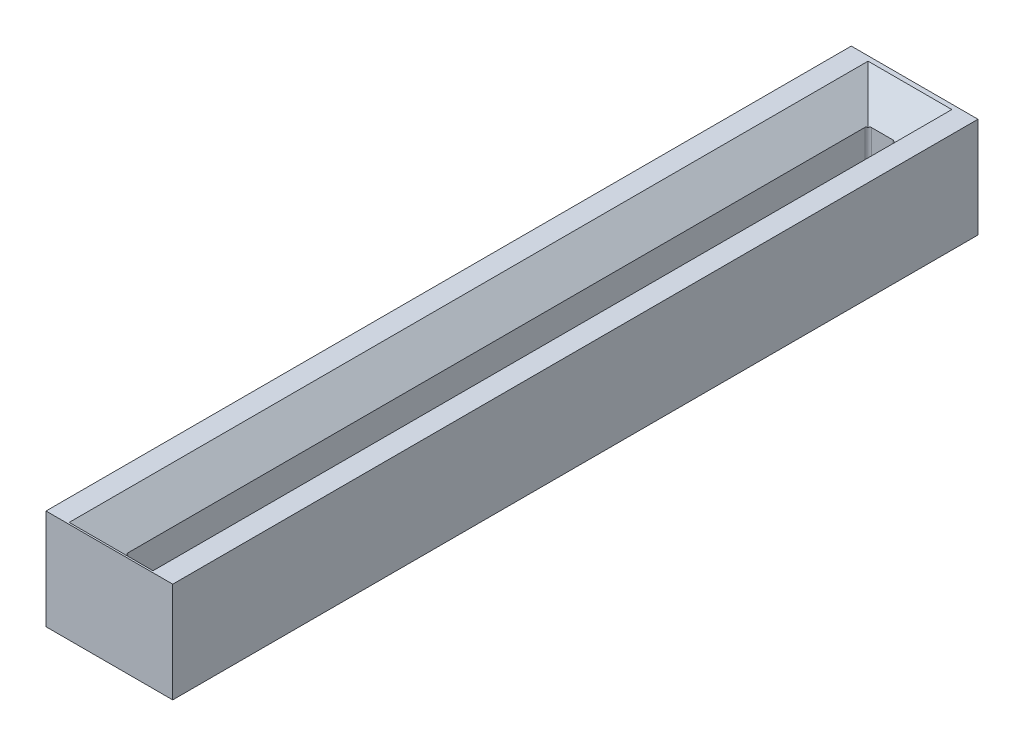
ISO-10303-21;
HEADER;
FILE_DESCRIPTION(('STEP AP214'),'2;1');
FILE_NAME('part.step','',(''),(''),'','','');
FILE_SCHEMA(('AUTOMOTIVE_DESIGN { 1 0 10303 214 1 1 1 1 }'));
ENDSEC;
DATA;
#1=APPLICATION_CONTEXT('core data for automotive mechanical design processes');
#2=APPLICATION_PROTOCOL_DEFINITION('international standard','automotive_design',2000,#1);
#3=PRODUCT_CONTEXT('',#1,'mechanical');
#4=PRODUCT('Part','Part','',(#3));
#5=PRODUCT_RELATED_PRODUCT_CATEGORY('part','',(#4));
#6=PRODUCT_DEFINITION_FORMATION('','',#4);
#7=PRODUCT_DEFINITION_CONTEXT('part definition',#1,'design');
#8=PRODUCT_DEFINITION('design','',#6,#7);
#9=PRODUCT_DEFINITION_SHAPE('','',#8);
#10=(LENGTH_UNIT() NAMED_UNIT(*) SI_UNIT(.MILLI.,.METRE.));
#11=(NAMED_UNIT(*) PLANE_ANGLE_UNIT() SI_UNIT($,.RADIAN.));
#12=(NAMED_UNIT(*) SI_UNIT($,.STERADIAN.) SOLID_ANGLE_UNIT());
#13=UNCERTAINTY_MEASURE_WITH_UNIT(LENGTH_MEASURE(1.E-05),#10,'distance_accuracy_value','');
#14=(GEOMETRIC_REPRESENTATION_CONTEXT(3) GLOBAL_UNCERTAINTY_ASSIGNED_CONTEXT((#13)) GLOBAL_UNIT_ASSIGNED_CONTEXT((#10,
#11,#12)) REPRESENTATION_CONTEXT('',''));
#15=CARTESIAN_POINT('',(0.,0.,0.));
#16=DIRECTION('',(0.,0.,1.));
#17=DIRECTION('',(1.,0.,0.));
#18=AXIS2_PLACEMENT_3D('',#15,#16,#17);
#19=CARTESIAN_POINT('',(0.,203.2,0.));
#20=DIRECTION('',(0.,1.,0.));
#21=DIRECTION('',(0.,0.,1.));
#22=AXIS2_PLACEMENT_3D('',#19,#20,#21);
#23=PLANE('',#22);
#24=DIRECTION('',(1.,0.,0.));
#25=VECTOR('',#24,1.);
#26=CARTESIAN_POINT('',(579.19737049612,203.2,-1638.));
#27=LINE('',#26,#25);
#28=CARTESIAN_POINT('',(-256.825000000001,203.2,-1638.));
#29=VERTEX_POINT('',#28);
#30=CARTESIAN_POINT('',(256.824999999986,203.2,-1638.));
#31=VERTEX_POINT('',#30);
#32=EDGE_CURVE('E205',#29,#31,#27,.T.);
#33=ORIENTED_EDGE('',*,*,#32,.F.);
#34=DIRECTION('',(0.,0.,1.));
#35=VECTOR('',#34,1.);
#36=CARTESIAN_POINT('',(-256.825,203.2,1706.025));
#37=LINE('',#36,#35);
#38=CARTESIAN_POINT('',(-256.825,203.2,1626.));
#39=VERTEX_POINT('',#38);
#40=EDGE_CURVE('E200',#29,#39,#37,.T.);
#41=ORIENTED_EDGE('',*,*,#40,.T.);
#42=DIRECTION('',(-1.,0.,0.));
#43=VECTOR('',#42,1.);
#44=CARTESIAN_POINT('',(435.039056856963,203.2,1626.));
#45=LINE('',#44,#43);
#46=CARTESIAN_POINT('',(256.824999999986,203.2,1626.));
#47=VERTEX_POINT('',#46);
#48=EDGE_CURVE('E62',#47,#39,#45,.T.);
#49=ORIENTED_EDGE('',*,*,#48,.F.);
#50=DIRECTION('',(0.,0.,-1.));
#51=VECTOR('',#50,1.);
#52=CARTESIAN_POINT('',(256.824999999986,203.2,1706.025));
#53=LINE('',#52,#51);
#54=EDGE_CURVE('E199',#47,#31,#53,.T.);
#55=ORIENTED_EDGE('',*,*,#54,.T.);
#56=EDGE_LOOP('',(#33,#41,#49,#55));
#57=FACE_BOUND('',#56,.T.);
#58=DIRECTION('',(1.,0.,0.));
#59=VECTOR('',#58,1.);
#60=CARTESIAN_POINT('',(0.,203.2,-1619.));
#61=LINE('',#60,#59);
#62=CARTESIAN_POINT('',(-169.8,203.2,-1619.));
#63=VERTEX_POINT('',#62);
#64=CARTESIAN_POINT('',(169.8,203.2,-1619.));
#65=VERTEX_POINT('',#64);
#66=EDGE_CURVE('E234',#63,#65,#61,.T.);
#67=ORIENTED_EDGE('',*,*,#66,.T.);
#68=DIRECTION('',(0.,0.,1.));
#69=VECTOR('',#68,1.);
#70=CARTESIAN_POINT('',(169.8,203.2,0.));
#71=LINE('',#70,#69);
#72=CARTESIAN_POINT('',(169.8,203.2,1619.));
#73=VERTEX_POINT('',#72);
#74=EDGE_CURVE('E240',#65,#73,#71,.T.);
#75=ORIENTED_EDGE('',*,*,#74,.T.);
#76=DIRECTION('',(-1.,0.,0.));
#77=VECTOR('',#76,1.);
#78=CARTESIAN_POINT('',(0.,203.2,1619.));
#79=LINE('',#78,#77);
#80=CARTESIAN_POINT('',(-169.8,203.2,1619.));
#81=VERTEX_POINT('',#80);
#82=EDGE_CURVE('E226',#73,#81,#79,.T.);
#83=ORIENTED_EDGE('',*,*,#82,.T.);
#84=DIRECTION('',(0.,0.,-1.));
#85=VECTOR('',#84,1.);
#86=CARTESIAN_POINT('',(-169.8,203.2,0.));
#87=LINE('',#86,#85);
#88=EDGE_CURVE('E233',#81,#63,#87,.T.);
#89=ORIENTED_EDGE('',*,*,#88,.T.);
#90=EDGE_LOOP('',(#67,#75,#83,#89));
#91=FACE_BOUND('',#90,.T.);
#92=ADVANCED_FACE('F50',(#57,#91),#23,.T.);
#93=CARTESIAN_POINT('',(0.,-203.2,0.));
#94=DIRECTION('',(0.,1.,0.));
#95=DIRECTION('',(0.,0.,1.));
#96=AXIS2_PLACEMENT_3D('',#93,#94,#95);
#97=PLANE('',#96);
#98=DIRECTION('',(0.,0.,-1.));
#99=VECTOR('',#98,1.);
#100=CARTESIAN_POINT('',(169.8,-203.2,-1506.));
#101=LINE('',#100,#99);
#102=CARTESIAN_POINT('',(169.8,-203.2,1619.));
#103=VERTEX_POINT('',#102);
#104=CARTESIAN_POINT('',(169.8,-203.2,-1619.));
#105=VERTEX_POINT('',#104);
#106=EDGE_CURVE('E272',#103,#105,#101,.T.);
#107=ORIENTED_EDGE('',*,*,#106,.T.);
#108=DIRECTION('',(-1.,0.,0.));
#109=VECTOR('',#108,1.);
#110=CARTESIAN_POINT('',(-56.8000000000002,-203.2,-1619.));
#111=LINE('',#110,#109);
#112=CARTESIAN_POINT('',(-169.8,-203.2,-1619.));
#113=VERTEX_POINT('',#112);
#114=EDGE_CURVE('E274',#105,#113,#111,.T.);
#115=ORIENTED_EDGE('',*,*,#114,.T.);
#116=DIRECTION('',(0.,0.,1.));
#117=VECTOR('',#116,1.);
#118=CARTESIAN_POINT('',(-169.8,-203.2,1506.));
#119=LINE('',#118,#117);
#120=CARTESIAN_POINT('',(-169.8,-203.2,1619.));
#121=VERTEX_POINT('',#120);
#122=EDGE_CURVE('E268',#113,#121,#119,.T.);
#123=ORIENTED_EDGE('',*,*,#122,.T.);
#124=DIRECTION('',(1.,0.,0.));
#125=VECTOR('',#124,1.);
#126=CARTESIAN_POINT('',(56.8000000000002,-203.2,1619.));
#127=LINE('',#126,#125);
#128=EDGE_CURVE('E265',#121,#103,#127,.T.);
#129=ORIENTED_EDGE('',*,*,#128,.T.);
#130=EDGE_LOOP('',(#107,#115,#123,#129));
#131=FACE_BOUND('',#130,.T.);
#132=DIRECTION('',(0.,0.,1.));
#133=VECTOR('',#132,1.);
#134=CARTESIAN_POINT('',(-256.825,-203.2,1706.025));
#135=LINE('',#134,#133);
#136=CARTESIAN_POINT('',(-256.825000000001,-203.2,-1638.));
#137=VERTEX_POINT('',#136);
#138=CARTESIAN_POINT('',(-256.825,-203.2,1626.));
#139=VERTEX_POINT('',#138);
#140=EDGE_CURVE('E210',#137,#139,#135,.T.);
#141=ORIENTED_EDGE('',*,*,#140,.F.);
#142=DIRECTION('',(1.,0.,0.));
#143=VECTOR('',#142,1.);
#144=CARTESIAN_POINT('',(579.19737049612,-203.2,-1638.));
#145=LINE('',#144,#143);
#146=CARTESIAN_POINT('',(256.824999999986,-203.2,-1638.));
#147=VERTEX_POINT('',#146);
#148=EDGE_CURVE('E71',#137,#147,#145,.T.);
#149=ORIENTED_EDGE('',*,*,#148,.T.);
#150=DIRECTION('',(0.,0.,-1.));
#151=VECTOR('',#150,1.);
#152=CARTESIAN_POINT('',(256.824999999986,-203.2,1706.025));
#153=LINE('',#152,#151);
#154=CARTESIAN_POINT('',(256.824999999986,-203.2,1626.));
#155=VERTEX_POINT('',#154);
#156=EDGE_CURVE('E213',#155,#147,#153,.T.);
#157=ORIENTED_EDGE('',*,*,#156,.F.);
#158=DIRECTION('',(-1.,0.,0.));
#159=VECTOR('',#158,1.);
#160=CARTESIAN_POINT('',(435.039056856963,-203.2,1626.));
#161=LINE('',#160,#159);
#162=EDGE_CURVE('E184',#155,#139,#161,.T.);
#163=ORIENTED_EDGE('',*,*,#162,.T.);
#164=EDGE_LOOP('',(#141,#149,#157,#163));
#165=FACE_BOUND('',#164,.T.);
#166=ADVANCED_FACE('F391',(#131,#165),#97,.F.);
#167=CARTESIAN_POINT('',(256.824999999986,203.2,1706.025));
#168=DIRECTION('',(-1.,0.,0.));
#169=DIRECTION('',(0.,0.,1.));
#170=AXIS2_PLACEMENT_3D('',#167,#168,#169);
#171=PLANE('',#170);
#172=ORIENTED_EDGE('',*,*,#156,.T.);
#173=DIRECTION('',(0.,1.,0.));
#174=VECTOR('',#173,1.);
#175=CARTESIAN_POINT('',(256.824999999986,203.2,-1638.));
#176=LINE('',#175,#174);
#177=EDGE_CURVE('E191',#147,#31,#176,.T.);
#178=ORIENTED_EDGE('',*,*,#177,.T.);
#179=ORIENTED_EDGE('',*,*,#54,.F.);
#180=DIRECTION('',(0.,-1.,0.));
#181=VECTOR('',#180,1.);
#182=CARTESIAN_POINT('',(256.824999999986,203.2,1626.));
#183=LINE('',#182,#181);
#184=EDGE_CURVE('E185',#47,#155,#183,.T.);
#185=ORIENTED_EDGE('',*,*,#184,.T.);
#186=EDGE_LOOP('',(#172,#178,#179,#185));
#187=FACE_BOUND('',#186,.T.);
#188=ADVANCED_FACE('F204',(#187),#171,.F.);
#189=CARTESIAN_POINT('',(-256.825,203.2,1706.025));
#190=DIRECTION('',(1.,0.,0.));
#191=DIRECTION('',(0.,0.,-1.));
#192=AXIS2_PLACEMENT_3D('',#189,#190,#191);
#193=PLANE('',#192);
#194=ORIENTED_EDGE('',*,*,#40,.F.);
#195=DIRECTION('',(0.,-1.,0.));
#196=VECTOR('',#195,1.);
#197=CARTESIAN_POINT('',(-256.825000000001,203.2,-1638.));
#198=LINE('',#197,#196);
#199=EDGE_CURVE('E11',#29,#137,#198,.T.);
#200=ORIENTED_EDGE('',*,*,#199,.T.);
#201=ORIENTED_EDGE('',*,*,#140,.T.);
#202=DIRECTION('',(0.,1.,0.));
#203=VECTOR('',#202,1.);
#204=CARTESIAN_POINT('',(-256.825,203.2,1626.));
#205=LINE('',#204,#203);
#206=EDGE_CURVE('E57',#139,#39,#205,.T.);
#207=ORIENTED_EDGE('',*,*,#206,.T.);
#208=EDGE_LOOP('',(#194,#200,#201,#207));
#209=FACE_BOUND('',#208,.T.);
#210=ADVANCED_FACE('F387',(#209),#193,.F.);
#211=CARTESIAN_POINT('',(-56.8000000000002,203.2,-1506.));
#212=DIRECTION('',(1.,0.,0.));
#213=DIRECTION('',(0.,0.,-1.));
#214=AXIS2_PLACEMENT_3D('',#211,#212,#213);
#215=PLANE('',#214);
#216=DIRECTION('',(0.,0.,1.));
#217=VECTOR('',#216,1.);
#218=CARTESIAN_POINT('',(-56.8000000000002,90.2000000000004,-1506.));
#219=LINE('',#218,#217);
#220=CARTESIAN_POINT('',(-56.8000000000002,90.2000000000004,-1493.));
#221=VERTEX_POINT('',#220);
#222=CARTESIAN_POINT('',(-56.7999999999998,90.2000000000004,1493.));
#223=VERTEX_POINT('',#222);
#224=EDGE_CURVE('E254',#221,#223,#219,.T.);
#225=ORIENTED_EDGE('',*,*,#224,.T.);
#226=DIRECTION('',(0.,-1.,0.));
#227=VECTOR('',#226,1.);
#228=CARTESIAN_POINT('',(-56.7999999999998,-90.1999999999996,1493.));
#229=LINE('',#228,#227);
#230=CARTESIAN_POINT('',(-56.7999999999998,-90.1999999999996,1493.));
#231=VERTEX_POINT('',#230);
#232=EDGE_CURVE('E318',#223,#231,#229,.T.);
#233=ORIENTED_EDGE('',*,*,#232,.T.);
#234=DIRECTION('',(0.,0.,-1.));
#235=VECTOR('',#234,1.);
#236=CARTESIAN_POINT('',(-56.8000000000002,-90.1999999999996,-1506.));
#237=LINE('',#236,#235);
#238=CARTESIAN_POINT('',(-56.8000000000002,-90.1999999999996,-1493.));
#239=VERTEX_POINT('',#238);
#240=EDGE_CURVE('E248',#231,#239,#237,.T.);
#241=ORIENTED_EDGE('',*,*,#240,.T.);
#242=DIRECTION('',(0.,-1.,0.));
#243=VECTOR('',#242,1.);
#244=CARTESIAN_POINT('',(-56.8000000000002,90.2000000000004,-1493.));
#245=LINE('',#244,#243);
#246=EDGE_CURVE('E320',#239,#221,#245,.F.);
#247=ORIENTED_EDGE('',*,*,#246,.T.);
#248=EDGE_LOOP('',(#225,#233,#241,#247));
#249=FACE_BOUND('',#248,.T.);
#250=ADVANCED_FACE('F415',(#249),#215,.T.);
#251=CARTESIAN_POINT('',(-56.7999999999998,203.2,1506.));
#252=DIRECTION('',(0.,0.,-1.));
#253=DIRECTION('',(-1.,0.,0.));
#254=AXIS2_PLACEMENT_3D('',#251,#252,#253);
#255=PLANE('',#254);
#256=DIRECTION('',(1.,0.,0.));
#257=VECTOR('',#256,1.);
#258=CARTESIAN_POINT('',(-56.7999999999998,90.2000000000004,1506.));
#259=LINE('',#258,#257);
#260=CARTESIAN_POINT('',(-43.7999999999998,90.2000000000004,1506.));
#261=VERTEX_POINT('',#260);
#262=CARTESIAN_POINT('',(43.8000000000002,90.2000000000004,1506.));
#263=VERTEX_POINT('',#262);
#264=EDGE_CURVE('E261',#261,#263,#259,.T.);
#265=ORIENTED_EDGE('',*,*,#264,.T.);
#266=DIRECTION('',(0.,-1.,0.));
#267=VECTOR('',#266,1.);
#268=CARTESIAN_POINT('',(43.8000000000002,-90.1999999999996,1506.));
#269=LINE('',#268,#267);
#270=CARTESIAN_POINT('',(43.8000000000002,-90.1999999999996,1506.));
#271=VERTEX_POINT('',#270);
#272=EDGE_CURVE('E306',#263,#271,#269,.T.);
#273=ORIENTED_EDGE('',*,*,#272,.T.);
#274=DIRECTION('',(-1.,0.,0.));
#275=VECTOR('',#274,1.);
#276=CARTESIAN_POINT('',(-56.7999999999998,-90.1999999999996,1506.));
#277=LINE('',#276,#275);
#278=CARTESIAN_POINT('',(-43.7999999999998,-90.1999999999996,1506.));
#279=VERTEX_POINT('',#278);
#280=EDGE_CURVE('E260',#271,#279,#277,.T.);
#281=ORIENTED_EDGE('',*,*,#280,.T.);
#282=DIRECTION('',(0.,-1.,0.));
#283=VECTOR('',#282,1.);
#284=CARTESIAN_POINT('',(-43.7999999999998,90.2000000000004,1506.));
#285=LINE('',#284,#283);
#286=EDGE_CURVE('E277',#279,#261,#285,.F.);
#287=ORIENTED_EDGE('',*,*,#286,.T.);
#288=EDGE_LOOP('',(#265,#273,#281,#287));
#289=FACE_BOUND('',#288,.T.);
#290=ADVANCED_FACE('F530',(#289),#255,.T.);
#291=CARTESIAN_POINT('',(56.8000000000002,203.2,1506.));
#292=DIRECTION('',(-1.,0.,0.));
#293=DIRECTION('',(0.,0.,1.));
#294=AXIS2_PLACEMENT_3D('',#291,#292,#293);
#295=PLANE('',#294);
#296=DIRECTION('',(0.,0.,1.));
#297=VECTOR('',#296,1.);
#298=CARTESIAN_POINT('',(56.8000000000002,-90.1999999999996,1506.));
#299=LINE('',#298,#297);
#300=CARTESIAN_POINT('',(56.7999999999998,-90.1999999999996,-1493.));
#301=VERTEX_POINT('',#300);
#302=CARTESIAN_POINT('',(56.8000000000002,-90.1999999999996,1493.));
#303=VERTEX_POINT('',#302);
#304=EDGE_CURVE('E211',#301,#303,#299,.T.);
#305=ORIENTED_EDGE('',*,*,#304,.T.);
#306=DIRECTION('',(0.,-1.,0.));
#307=VECTOR('',#306,1.);
#308=CARTESIAN_POINT('',(56.8000000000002,90.2000000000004,1493.));
#309=LINE('',#308,#307);
#310=CARTESIAN_POINT('',(56.8000000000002,90.2000000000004,1493.));
#311=VERTEX_POINT('',#310);
#312=EDGE_CURVE('E313',#303,#311,#309,.F.);
#313=ORIENTED_EDGE('',*,*,#312,.T.);
#314=DIRECTION('',(0.,0.,-1.));
#315=VECTOR('',#314,1.);
#316=CARTESIAN_POINT('',(56.8000000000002,90.2000000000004,1506.));
#317=LINE('',#316,#315);
#318=CARTESIAN_POINT('',(56.7999999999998,90.2000000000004,-1493.));
#319=VERTEX_POINT('',#318);
#320=EDGE_CURVE('E222',#311,#319,#317,.T.);
#321=ORIENTED_EDGE('',*,*,#320,.T.);
#322=DIRECTION('',(0.,-1.,0.));
#323=VECTOR('',#322,1.);
#324=CARTESIAN_POINT('',(56.7999999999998,-90.1999999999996,-1493.));
#325=LINE('',#324,#323);
#326=EDGE_CURVE('E309',#319,#301,#325,.T.);
#327=ORIENTED_EDGE('',*,*,#326,.T.);
#328=EDGE_LOOP('',(#305,#313,#321,#327));
#329=FACE_BOUND('',#328,.T.);
#330=ADVANCED_FACE('F540',(#329),#295,.T.);
#331=CARTESIAN_POINT('',(56.7999999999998,203.2,-1506.));
#332=DIRECTION('',(0.,0.,1.));
#333=DIRECTION('',(1.,0.,0.));
#334=AXIS2_PLACEMENT_3D('',#331,#332,#333);
#335=PLANE('',#334);
#336=DIRECTION('',(-1.,0.,0.));
#337=VECTOR('',#336,1.);
#338=CARTESIAN_POINT('',(56.7999999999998,90.2000000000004,-1506.));
#339=LINE('',#338,#337);
#340=CARTESIAN_POINT('',(43.7999999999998,90.2000000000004,-1506.));
#341=VERTEX_POINT('',#340);
#342=CARTESIAN_POINT('',(-43.8000000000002,90.2000000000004,-1506.));
#343=VERTEX_POINT('',#342);
#344=EDGE_CURVE('E244',#341,#343,#339,.T.);
#345=ORIENTED_EDGE('',*,*,#344,.T.);
#346=DIRECTION('',(0.,-1.,0.));
#347=VECTOR('',#346,1.);
#348=CARTESIAN_POINT('',(-43.8000000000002,-90.1999999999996,-1506.));
#349=LINE('',#348,#347);
#350=CARTESIAN_POINT('',(-43.8000000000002,-90.1999999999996,-1506.));
#351=VERTEX_POINT('',#350);
#352=EDGE_CURVE('E327',#343,#351,#349,.T.);
#353=ORIENTED_EDGE('',*,*,#352,.T.);
#354=DIRECTION('',(1.,0.,0.));
#355=VECTOR('',#354,1.);
#356=CARTESIAN_POINT('',(56.7999999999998,-90.1999999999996,-1506.));
#357=LINE('',#356,#355);
#358=CARTESIAN_POINT('',(43.7999999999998,-90.1999999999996,-1506.));
#359=VERTEX_POINT('',#358);
#360=EDGE_CURVE('E241',#351,#359,#357,.T.);
#361=ORIENTED_EDGE('',*,*,#360,.T.);
#362=DIRECTION('',(0.,-1.,0.));
#363=VECTOR('',#362,1.);
#364=CARTESIAN_POINT('',(43.7999999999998,90.2000000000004,-1506.));
#365=LINE('',#364,#363);
#366=EDGE_CURVE('E323',#359,#341,#365,.F.);
#367=ORIENTED_EDGE('',*,*,#366,.T.);
#368=EDGE_LOOP('',(#345,#353,#361,#367));
#369=FACE_BOUND('',#368,.T.);
#370=ADVANCED_FACE('F451',(#369),#335,.T.);
#371=CARTESIAN_POINT('',(-56.8000000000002,90.2000000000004,-1506.));
#372=DIRECTION('',(-0.707106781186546,-0.707106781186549,0.));
#373=DIRECTION('',(0.,0.,1.));
#374=AXIS2_PLACEMENT_3D('',#371,#372,#373);
#375=PLANE('',#374);
#376=DIRECTION('',(-0.577350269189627,0.577350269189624,-0.577350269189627));
#377=VECTOR('',#376,1.);
#378=CARTESIAN_POINT('',(-18.9333333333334,52.3333333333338,-1468.13333333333));
#379=LINE('',#378,#377);
#380=CARTESIAN_POINT('',(-52.9923881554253,86.3923881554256,-1502.19238815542));
#381=VERTEX_POINT('',#380);
#382=EDGE_CURVE('E286',#63,#381,#379,.F.);
#383=ORIENTED_EDGE('',*,*,#382,.F.);
#384=ORIENTED_EDGE('',*,*,#88,.F.);
#385=DIRECTION('',(-0.577350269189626,0.577350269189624,0.577350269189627));
#386=VECTOR('',#385,1.);
#387=CARTESIAN_POINT('',(947.200000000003,-913.799999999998,501.999999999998));
#388=LINE('',#387,#386);
#389=CARTESIAN_POINT('',(-52.9923881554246,86.3923881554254,1502.19238815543));
#390=VERTEX_POINT('',#389);
#391=EDGE_CURVE('E218',#390,#81,#388,.T.);
#392=ORIENTED_EDGE('',*,*,#391,.F.);
#393=CARTESIAN_POINT('',(-43.7999999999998,77.2000000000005,1493.));
#394=DIRECTION('',(-0.707106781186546,-0.707106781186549,0.));
#395=DIRECTION('',(-0.707106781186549,0.707106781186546,0.));
#396=AXIS2_PLACEMENT_3D('',#393,#394,#395);
#397=ELLIPSE('',#396,18.3847763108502,13.);
#398=EDGE_CURVE('E358',#390,#223,#397,.T.);
#399=ORIENTED_EDGE('',*,*,#398,.T.);
#400=ORIENTED_EDGE('',*,*,#224,.F.);
#401=CARTESIAN_POINT('',(-43.8000000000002,77.2000000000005,-1493.));
#402=DIRECTION('',(-0.707106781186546,-0.707106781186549,0.));
#403=DIRECTION('',(-0.707106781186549,0.707106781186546,0.));
#404=AXIS2_PLACEMENT_3D('',#401,#402,#403);
#405=ELLIPSE('',#404,18.3847763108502,13.);
#406=EDGE_CURVE('E366',#221,#381,#405,.T.);
#407=ORIENTED_EDGE('',*,*,#406,.T.);
#408=EDGE_LOOP('',(#383,#384,#392,#399,#400,#407));
#409=FACE_BOUND('',#408,.T.);
#410=ADVANCED_FACE('F444',(#409),#375,.F.);
#411=CARTESIAN_POINT('',(-56.7999999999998,90.2000000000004,1506.));
#412=DIRECTION('',(0.,-0.707106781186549,0.707106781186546));
#413=DIRECTION('',(1.,0.,0.));
#414=AXIS2_PLACEMENT_3D('',#411,#412,#413);
#415=PLANE('',#414);
#416=ORIENTED_EDGE('',*,*,#391,.T.);
#417=ORIENTED_EDGE('',*,*,#82,.F.);
#418=DIRECTION('',(-0.577350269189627,-0.577350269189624,-0.577350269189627));
#419=VECTOR('',#418,1.);
#420=CARTESIAN_POINT('',(56.8000000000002,90.2000000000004,1506.));
#421=LINE('',#420,#419);
#422=CARTESIAN_POINT('',(52.9923881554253,86.3923881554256,1502.19238815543));
#423=VERTEX_POINT('',#422);
#424=EDGE_CURVE('E282',#423,#73,#421,.F.);
#425=ORIENTED_EDGE('',*,*,#424,.F.);
#426=CARTESIAN_POINT('',(43.8000000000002,77.2000000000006,1493.));
#427=DIRECTION('',(0.,-0.707106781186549,0.707106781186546));
#428=DIRECTION('',(0.,0.707106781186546,0.707106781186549));
#429=AXIS2_PLACEMENT_3D('',#426,#427,#428);
#430=ELLIPSE('',#429,18.3847763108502,13.);
#431=EDGE_CURVE('E345',#423,#263,#430,.T.);
#432=ORIENTED_EDGE('',*,*,#431,.T.);
#433=ORIENTED_EDGE('',*,*,#264,.F.);
#434=CARTESIAN_POINT('',(-43.7999999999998,77.2000000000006,1493.));
#435=DIRECTION('',(0.,-0.707106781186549,0.707106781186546));
#436=DIRECTION('',(0.,0.707106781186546,0.707106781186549));
#437=AXIS2_PLACEMENT_3D('',#434,#435,#436);
#438=ELLIPSE('',#437,18.3847763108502,13.);
#439=EDGE_CURVE('E355',#261,#390,#438,.T.);
#440=ORIENTED_EDGE('',*,*,#439,.T.);
#441=EDGE_LOOP('',(#416,#417,#425,#432,#433,#440));
#442=FACE_BOUND('',#441,.T.);
#443=ADVANCED_FACE('F438',(#442),#415,.F.);
#444=CARTESIAN_POINT('',(56.7999999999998,90.2000000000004,-1506.));
#445=DIRECTION('',(0.,-0.707106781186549,-0.707106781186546));
#446=DIRECTION('',(-1.,0.,0.));
#447=AXIS2_PLACEMENT_3D('',#444,#445,#446);
#448=PLANE('',#447);
#449=ORIENTED_EDGE('',*,*,#382,.T.);
#450=CARTESIAN_POINT('',(-43.8000000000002,77.2000000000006,-1493.));
#451=DIRECTION('',(0.,-0.707106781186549,-0.707106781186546));
#452=DIRECTION('',(0.,0.707106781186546,-0.707106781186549));
#453=AXIS2_PLACEMENT_3D('',#450,#451,#452);
#454=ELLIPSE('',#453,18.3847763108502,13.);
#455=EDGE_CURVE('E369',#381,#343,#454,.T.);
#456=ORIENTED_EDGE('',*,*,#455,.T.);
#457=ORIENTED_EDGE('',*,*,#344,.F.);
#458=CARTESIAN_POINT('',(43.7999999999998,77.2000000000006,-1493.));
#459=DIRECTION('',(0.,-0.707106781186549,-0.707106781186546));
#460=DIRECTION('',(0.,0.707106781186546,-0.707106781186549));
#461=AXIS2_PLACEMENT_3D('',#458,#459,#460);
#462=ELLIPSE('',#461,18.3847763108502,13.);
#463=CARTESIAN_POINT('',(52.9923881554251,86.3923881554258,-1502.19238815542));
#464=VERTEX_POINT('',#463);
#465=EDGE_CURVE('E379',#341,#464,#462,.T.);
#466=ORIENTED_EDGE('',*,*,#465,.T.);
#467=DIRECTION('',(0.577350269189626,0.577350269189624,-0.577350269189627));
#468=VECTOR('',#467,1.);
#469=CARTESIAN_POINT('',(-947.200000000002,-913.799999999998,-501.999999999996));
#470=LINE('',#469,#468);
#471=EDGE_CURVE('E278',#65,#464,#470,.F.);
#472=ORIENTED_EDGE('',*,*,#471,.F.);
#473=ORIENTED_EDGE('',*,*,#66,.F.);
#474=EDGE_LOOP('',(#449,#456,#457,#466,#472,#473));
#475=FACE_BOUND('',#474,.T.);
#476=ADVANCED_FACE('F431',(#475),#448,.F.);
#477=CARTESIAN_POINT('',(56.8000000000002,90.2000000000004,1506.));
#478=DIRECTION('',(0.707106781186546,-0.707106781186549,0.));
#479=DIRECTION('',(0.,0.,-1.));
#480=AXIS2_PLACEMENT_3D('',#477,#478,#479);
#481=PLANE('',#480);
#482=ORIENTED_EDGE('',*,*,#424,.T.);
#483=ORIENTED_EDGE('',*,*,#74,.F.);
#484=ORIENTED_EDGE('',*,*,#471,.T.);
#485=CARTESIAN_POINT('',(43.7999999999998,77.2000000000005,-1493.));
#486=DIRECTION('',(0.707106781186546,-0.707106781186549,0.));
#487=DIRECTION('',(0.707106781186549,0.707106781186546,0.));
#488=AXIS2_PLACEMENT_3D('',#485,#486,#487);
#489=ELLIPSE('',#488,18.3847763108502,13.);
#490=EDGE_CURVE('E381',#464,#319,#489,.T.);
#491=ORIENTED_EDGE('',*,*,#490,.T.);
#492=ORIENTED_EDGE('',*,*,#320,.F.);
#493=CARTESIAN_POINT('',(43.8000000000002,77.2000000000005,1493.));
#494=DIRECTION('',(0.707106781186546,-0.707106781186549,0.));
#495=DIRECTION('',(0.707106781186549,0.707106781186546,0.));
#496=AXIS2_PLACEMENT_3D('',#493,#494,#495);
#497=ELLIPSE('',#496,18.3847763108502,13.);
#498=EDGE_CURVE('E336',#311,#423,#497,.T.);
#499=ORIENTED_EDGE('',*,*,#498,.T.);
#500=EDGE_LOOP('',(#482,#483,#484,#491,#492,#499));
#501=FACE_BOUND('',#500,.T.);
#502=ADVANCED_FACE('F421',(#501),#481,.F.);
#503=CARTESIAN_POINT('',(0.,-203.2,1619.));
#504=DIRECTION('',(0.,-0.707106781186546,-0.707106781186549));
#505=DIRECTION('',(-1.,0.,0.));
#506=AXIS2_PLACEMENT_3D('',#503,#504,#505);
#507=PLANE('',#506);
#508=DIRECTION('',(0.577350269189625,0.577350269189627,-0.577350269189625));
#509=VECTOR('',#508,1.);
#510=CARTESIAN_POINT('',(369.866666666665,336.466666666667,1079.33333333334));
#511=LINE('',#510,#509);
#512=CARTESIAN_POINT('',(-52.9923881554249,-86.3923881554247,1502.19238815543));
#513=VERTEX_POINT('',#512);
#514=EDGE_CURVE('E296',#513,#121,#511,.F.);
#515=ORIENTED_EDGE('',*,*,#514,.F.);
#516=CARTESIAN_POINT('',(-43.7999999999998,-77.1999999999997,1493.));
#517=DIRECTION('',(0.,-0.707106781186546,-0.707106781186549));
#518=DIRECTION('',(0.,0.707106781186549,-0.707106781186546));
#519=AXIS2_PLACEMENT_3D('',#516,#517,#518);
#520=ELLIPSE('',#519,18.3847763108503,13.);
#521=EDGE_CURVE('E348',#513,#279,#520,.F.);
#522=ORIENTED_EDGE('',*,*,#521,.T.);
#523=ORIENTED_EDGE('',*,*,#280,.F.);
#524=CARTESIAN_POINT('',(43.8000000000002,-77.1999999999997,1493.));
#525=DIRECTION('',(0.,-0.707106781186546,-0.707106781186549));
#526=DIRECTION('',(0.,0.707106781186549,-0.707106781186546));
#527=AXIS2_PLACEMENT_3D('',#524,#525,#526);
#528=ELLIPSE('',#527,18.3847763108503,13.);
#529=CARTESIAN_POINT('',(52.9923881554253,-86.3923881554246,1502.19238815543));
#530=VERTEX_POINT('',#529);
#531=EDGE_CURVE('E331',#271,#530,#528,.F.);
#532=ORIENTED_EDGE('',*,*,#531,.T.);
#533=DIRECTION('',(0.577350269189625,-0.577350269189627,0.577350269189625));
#534=VECTOR('',#533,1.);
#535=CARTESIAN_POINT('',(-369.866666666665,336.466666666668,1079.33333333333));
#536=LINE('',#535,#534);
#537=EDGE_CURVE('E284',#103,#530,#536,.F.);
#538=ORIENTED_EDGE('',*,*,#537,.F.);
#539=ORIENTED_EDGE('',*,*,#128,.F.);
#540=EDGE_LOOP('',(#515,#522,#523,#532,#538,#539));
#541=FACE_BOUND('',#540,.T.);
#542=ADVANCED_FACE('F427',(#541),#507,.T.);
#543=CARTESIAN_POINT('',(169.8,-203.2,0.));
#544=DIRECTION('',(-0.707106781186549,-0.707106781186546,0.));
#545=DIRECTION('',(0.,0.,1.));
#546=AXIS2_PLACEMENT_3D('',#543,#544,#545);
#547=PLANE('',#546);
#548=ORIENTED_EDGE('',*,*,#537,.T.);
#549=CARTESIAN_POINT('',(43.8000000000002,-77.1999999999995,1493.));
#550=DIRECTION('',(-0.707106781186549,-0.707106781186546,0.));
#551=DIRECTION('',(-0.707106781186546,0.707106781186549,0.));
#552=AXIS2_PLACEMENT_3D('',#549,#550,#551);
#553=ELLIPSE('',#552,18.3847763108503,13.);
#554=EDGE_CURVE('E334',#530,#303,#553,.F.);
#555=ORIENTED_EDGE('',*,*,#554,.T.);
#556=ORIENTED_EDGE('',*,*,#304,.F.);
#557=CARTESIAN_POINT('',(43.7999999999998,-77.1999999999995,-1493.));
#558=DIRECTION('',(-0.707106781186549,-0.707106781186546,0.));
#559=DIRECTION('',(-0.707106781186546,0.707106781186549,0.));
#560=AXIS2_PLACEMENT_3D('',#557,#558,#559);
#561=ELLIPSE('',#560,18.3847763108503,13.);
#562=CARTESIAN_POINT('',(52.9923881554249,-86.3923881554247,-1502.19238815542));
#563=VERTEX_POINT('',#562);
#564=EDGE_CURVE('E373',#301,#563,#561,.F.);
#565=ORIENTED_EDGE('',*,*,#564,.T.);
#566=DIRECTION('',(0.577350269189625,-0.577350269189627,-0.577350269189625));
#567=VECTOR('',#566,1.);
#568=CARTESIAN_POINT('',(113.2,-146.6,-1562.4));
#569=LINE('',#568,#567);
#570=EDGE_CURVE('E294',#105,#563,#569,.F.);
#571=ORIENTED_EDGE('',*,*,#570,.F.);
#572=ORIENTED_EDGE('',*,*,#106,.F.);
#573=EDGE_LOOP('',(#548,#555,#556,#565,#571,#572));
#574=FACE_BOUND('',#573,.T.);
#575=ADVANCED_FACE('F466',(#574),#547,.T.);
#576=CARTESIAN_POINT('',(-169.8,-203.2,0.));
#577=DIRECTION('',(0.707106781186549,-0.707106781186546,0.));
#578=DIRECTION('',(0.,0.,-1.));
#579=AXIS2_PLACEMENT_3D('',#576,#577,#578);
#580=PLANE('',#579);
#581=ORIENTED_EDGE('',*,*,#514,.T.);
#582=ORIENTED_EDGE('',*,*,#122,.F.);
#583=DIRECTION('',(0.577350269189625,0.577350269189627,0.577350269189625));
#584=VECTOR('',#583,1.);
#585=CARTESIAN_POINT('',(-113.2,-146.6,-1562.4));
#586=LINE('',#585,#584);
#587=CARTESIAN_POINT('',(-52.9923881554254,-86.3923881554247,-1502.19238815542));
#588=VERTEX_POINT('',#587);
#589=EDGE_CURVE('E292',#588,#113,#586,.F.);
#590=ORIENTED_EDGE('',*,*,#589,.F.);
#591=CARTESIAN_POINT('',(-43.8000000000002,-77.1999999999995,-1493.));
#592=DIRECTION('',(0.707106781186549,-0.707106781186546,0.));
#593=DIRECTION('',(0.707106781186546,0.707106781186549,0.));
#594=AXIS2_PLACEMENT_3D('',#591,#592,#593);
#595=ELLIPSE('',#594,18.3847763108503,13.);
#596=EDGE_CURVE('E361',#588,#239,#595,.F.);
#597=ORIENTED_EDGE('',*,*,#596,.T.);
#598=ORIENTED_EDGE('',*,*,#240,.F.);
#599=CARTESIAN_POINT('',(-43.7999999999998,-77.1999999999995,1493.));
#600=DIRECTION('',(0.707106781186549,-0.707106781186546,0.));
#601=DIRECTION('',(0.707106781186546,0.707106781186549,0.));
#602=AXIS2_PLACEMENT_3D('',#599,#600,#601);
#603=ELLIPSE('',#602,18.3847763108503,13.);
#604=EDGE_CURVE('E344',#231,#513,#603,.F.);
#605=ORIENTED_EDGE('',*,*,#604,.T.);
#606=EDGE_LOOP('',(#581,#582,#590,#597,#598,#605));
#607=FACE_BOUND('',#606,.T.);
#608=ADVANCED_FACE('F461',(#607),#580,.T.);
#609=CARTESIAN_POINT('',(0.,-203.2,-1619.));
#610=DIRECTION('',(0.,-0.707106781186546,0.707106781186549));
#611=DIRECTION('',(1.,0.,0.));
#612=AXIS2_PLACEMENT_3D('',#609,#610,#611);
#613=PLANE('',#612);
#614=ORIENTED_EDGE('',*,*,#570,.T.);
#615=CARTESIAN_POINT('',(43.7999999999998,-77.1999999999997,-1493.));
#616=DIRECTION('',(0.,-0.707106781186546,0.707106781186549));
#617=DIRECTION('',(0.,0.707106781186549,0.707106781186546));
#618=AXIS2_PLACEMENT_3D('',#615,#616,#617);
#619=ELLIPSE('',#618,18.3847763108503,13.);
#620=EDGE_CURVE('E380',#563,#359,#619,.F.);
#621=ORIENTED_EDGE('',*,*,#620,.T.);
#622=ORIENTED_EDGE('',*,*,#360,.F.);
#623=CARTESIAN_POINT('',(-43.8000000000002,-77.1999999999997,-1493.));
#624=DIRECTION('',(0.,-0.707106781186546,0.707106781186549));
#625=DIRECTION('',(0.,0.707106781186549,0.707106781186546));
#626=AXIS2_PLACEMENT_3D('',#623,#624,#625);
#627=ELLIPSE('',#626,18.3847763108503,13.);
#628=EDGE_CURVE('E360',#351,#588,#627,.F.);
#629=ORIENTED_EDGE('',*,*,#628,.T.);
#630=ORIENTED_EDGE('',*,*,#589,.T.);
#631=ORIENTED_EDGE('',*,*,#114,.F.);
#632=EDGE_LOOP('',(#614,#621,#622,#629,#630,#631));
#633=FACE_BOUND('',#632,.T.);
#634=ADVANCED_FACE('F453',(#633),#613,.T.);
#635=CARTESIAN_POINT('',(43.8000000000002,203.2,1493.));
#636=DIRECTION('',(0.,1.,0.));
#637=DIRECTION('',(0.,0.,1.));
#638=AXIS2_PLACEMENT_3D('',#635,#636,#637);
#639=CYLINDRICAL_SURFACE('',#638,13.);
#640=ORIENTED_EDGE('',*,*,#498,.F.);
#641=ORIENTED_EDGE('',*,*,#312,.F.);
#642=ORIENTED_EDGE('',*,*,#554,.F.);
#643=ORIENTED_EDGE('',*,*,#531,.F.);
#644=ORIENTED_EDGE('',*,*,#272,.F.);
#645=ORIENTED_EDGE('',*,*,#431,.F.);
#646=EDGE_LOOP('',(#640,#641,#642,#643,#644,#645));
#647=FACE_BOUND('',#646,.T.);
#648=ADVANCED_FACE('F460',(#647),#639,.F.);
#649=CARTESIAN_POINT('',(-43.7999999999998,203.2,1493.));
#650=DIRECTION('',(0.,1.,0.));
#651=DIRECTION('',(0.,0.,1.));
#652=AXIS2_PLACEMENT_3D('',#649,#650,#651);
#653=CYLINDRICAL_SURFACE('',#652,13.);
#654=ORIENTED_EDGE('',*,*,#439,.F.);
#655=ORIENTED_EDGE('',*,*,#286,.F.);
#656=ORIENTED_EDGE('',*,*,#521,.F.);
#657=ORIENTED_EDGE('',*,*,#604,.F.);
#658=ORIENTED_EDGE('',*,*,#232,.F.);
#659=ORIENTED_EDGE('',*,*,#398,.F.);
#660=EDGE_LOOP('',(#654,#655,#656,#657,#658,#659));
#661=FACE_BOUND('',#660,.T.);
#662=ADVANCED_FACE('F485',(#661),#653,.F.);
#663=CARTESIAN_POINT('',(-43.8000000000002,203.2,-1493.));
#664=DIRECTION('',(0.,1.,0.));
#665=DIRECTION('',(0.,0.,1.));
#666=AXIS2_PLACEMENT_3D('',#663,#664,#665);
#667=CYLINDRICAL_SURFACE('',#666,13.);
#668=ORIENTED_EDGE('',*,*,#406,.F.);
#669=ORIENTED_EDGE('',*,*,#246,.F.);
#670=ORIENTED_EDGE('',*,*,#596,.F.);
#671=ORIENTED_EDGE('',*,*,#628,.F.);
#672=ORIENTED_EDGE('',*,*,#352,.F.);
#673=ORIENTED_EDGE('',*,*,#455,.F.);
#674=EDGE_LOOP('',(#668,#669,#670,#671,#672,#673));
#675=FACE_BOUND('',#674,.T.);
#676=ADVANCED_FACE('F484',(#675),#667,.F.);
#677=CARTESIAN_POINT('',(43.7999999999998,203.2,-1493.));
#678=DIRECTION('',(0.,1.,0.));
#679=DIRECTION('',(0.,0.,1.));
#680=AXIS2_PLACEMENT_3D('',#677,#678,#679);
#681=CYLINDRICAL_SURFACE('',#680,13.);
#682=ORIENTED_EDGE('',*,*,#465,.F.);
#683=ORIENTED_EDGE('',*,*,#366,.F.);
#684=ORIENTED_EDGE('',*,*,#620,.F.);
#685=ORIENTED_EDGE('',*,*,#564,.F.);
#686=ORIENTED_EDGE('',*,*,#326,.F.);
#687=ORIENTED_EDGE('',*,*,#490,.F.);
#688=EDGE_LOOP('',(#682,#683,#684,#685,#686,#687));
#689=FACE_BOUND('',#688,.T.);
#690=ADVANCED_FACE('F47',(#689),#681,.F.);
#691=CARTESIAN_POINT('',(435.039056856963,-203.2,1626.));
#692=DIRECTION('',(0.,0.,-1.));
#693=DIRECTION('',(-1.,0.,0.));
#694=AXIS2_PLACEMENT_3D('',#691,#692,#693);
#695=PLANE('',#694);
#696=ORIENTED_EDGE('',*,*,#48,.T.);
#697=ORIENTED_EDGE('',*,*,#206,.F.);
#698=ORIENTED_EDGE('',*,*,#162,.F.);
#699=ORIENTED_EDGE('',*,*,#184,.F.);
#700=EDGE_LOOP('',(#696,#697,#698,#699));
#701=FACE_BOUND('',#700,.T.);
#702=ADVANCED_FACE('F182',(#701),#695,.F.);
#703=CARTESIAN_POINT('',(579.19737049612,-203.2,-1638.));
#704=DIRECTION('',(0.,0.,1.));
#705=DIRECTION('',(1.,0.,0.));
#706=AXIS2_PLACEMENT_3D('',#703,#704,#705);
#707=PLANE('',#706);
#708=ORIENTED_EDGE('',*,*,#148,.F.);
#709=ORIENTED_EDGE('',*,*,#199,.F.);
#710=ORIENTED_EDGE('',*,*,#32,.T.);
#711=ORIENTED_EDGE('',*,*,#177,.F.);
#712=EDGE_LOOP('',(#708,#709,#710,#711));
#713=FACE_BOUND('',#712,.T.);
#714=ADVANCED_FACE('F398',(#713),#707,.F.);
#715=CLOSED_SHELL('',(#92,#166,#188,#210,#250,#290,#330,#370,#410,#443,#476,#502,#542,#575,#608,
#634,#648,#662,#676,#690,#702,#714));
#716=MANIFOLD_SOLID_BREP('B2',#715);
#717=ADVANCED_BREP_SHAPE_REPRESENTATION('',(#18,#716),#14);
#718=SHAPE_DEFINITION_REPRESENTATION(#9,#717);
ENDSEC;
END-ISO-10303-21;
